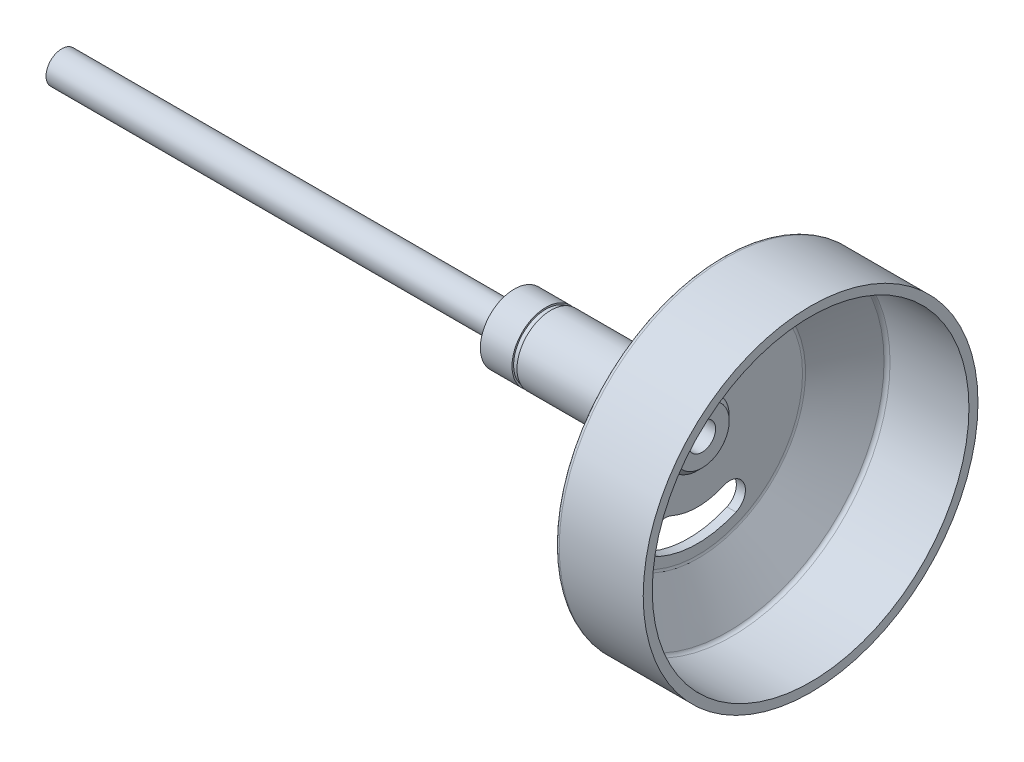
from build123d import *

# Parameters (mm, degrees)
ENL_V_MAT_EXTRU_1_REACH = 151.927


with BuildPart() as part:
    # Esquisse1 → R_volution1 (revolve)
    with BuildSketch(Plane.XY, mode=Mode.PRIVATE) as r_volution1_sk:
        with BuildLine():
            Line((-134.5, 0), (-134.5, 3.5))
            Line((-134.5, 3.5), (-34.5, 3.5))
            Line((-34.5, 3.5), (-34.5, 7.5))
            Line((-34.5, 7.5), (-27.5, 7.5))
            Line((-27.5, 7.5), (-27.5, 7.15))
            Line((-27.5, 7.15), (-26.4, 7.15))
            Line((-26.4, 7.15), (-26.4, 7.5))
            Line((-26.4, 7.5), (-4.6, 7.5))
            Line((-4.6, 7.5), (-4.6, 8.5))
            Line((-4.6, 8.5), (4, 8.5))
            Line((4, 8.5), (4, 23.780416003))
            ThreePointArc((4, 23.780416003), (4.037140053, 24.05041734), (4.145801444, 24.300362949))
            Line((4.145801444, 24.300362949), (11.583809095, 36.519946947))
            ThreePointArc((11.583809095, 36.519946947), (11.948082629, 36.871764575), (12.438007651, 37))
            Line((12.438007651, 37), (31, 37))
            Line((31, 37), (31, 35))
            Line((31, 35), (13.561992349, 35))
            ThreePointArc((13.561992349, 35), (13.072067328, 34.871764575), (12.707793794, 34.519946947))
            Line((12.707793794, 34.519946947), (6.145801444, 23.739530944))
            ThreePointArc((6.145801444, 23.739530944), (6.037140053, 23.489585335), (6, 23.219583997))
            Line((6, 23.219583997), (6, 7))
            Line((6, 7), (6.01, 7))
            Line((6.01, 7), (7, 6.01))
            Line((7, 6.01), (7, 3))
            Line((7, 3), (0, 3))
            Line((0, 3), (0, 0))
            Line((0, 0), (-134.5, 0))
        make_face()
    revolve(r_volution1_sk.sketch.rotate(Axis((-9.303801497, 0, 0), (1, 0, 0)), 90), axis=Axis((-9.303801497, 0, 0), (1, 0, 0)))

    # Esquisse2 → Enl_v. mat.-Extru.1 (cut, up to next)
    with BuildSketch(Plane(origin=(6, 0, 0), x_dir=(0, 0, -1), z_dir=(1, 0, 0)), mode=Mode.PRIVATE) as enl_v_mat_extru_1_sk1:
        with BuildLine():
            ThreePointArc((-5.670978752, -12.8), (0, -14), (5.670978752, -12.8))
            ThreePointArc((5.670978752, -12.8), (10.288723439, -14.582255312), (8.506468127, -19.2))
            ThreePointArc((8.506468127, -19.2), (0, -21), (-8.506468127, -19.2))
            ThreePointArc((-8.506468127, -19.2), (-10.288723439, -14.582255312), (-5.670978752, -12.8))
        make_face()
    enl_v_mat_extru_1_tool1 = extrude(enl_v_mat_extru_1_sk1.sketch, amount=-ENL_V_MAT_EXTRU_1_REACH, mode=Mode.PRIVATE) & part.part
    # Esquisse2 → Enl_v. mat.-Extru.1 (cut, up to next)
    with BuildSketch(Plane(origin=(6, 0, 0), x_dir=(0, 0, -1), z_dir=(1, 0, 0)), mode=Mode.PRIVATE) as enl_v_mat_extru_1_sk2:
        with BuildLine():
            ThreePointArc((-5.670978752, 12.8), (-10.288723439, 14.582255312), (-8.506468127, 19.2))
            ThreePointArc((-8.506468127, 19.2), (0, 21), (8.506468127, 19.2))
            ThreePointArc((8.506468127, 19.2), (10.288723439, 14.582255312), (5.670978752, 12.8))
            ThreePointArc((5.670978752, 12.8), (0, 14), (-5.670978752, 12.8))
        make_face()
    enl_v_mat_extru_1_tool2 = extrude(enl_v_mat_extru_1_sk2.sketch, amount=-ENL_V_MAT_EXTRU_1_REACH, mode=Mode.PRIVATE) & part.part
    add(enl_v_mat_extru_1_tool1.solids().sort_by_distance((6, -16.724287, 0))[0], mode=Mode.SUBTRACT)
    add(enl_v_mat_extru_1_tool2.solids().sort_by_distance((6, 16.724287, 0))[0], mode=Mode.SUBTRACT)


solid = part.part
